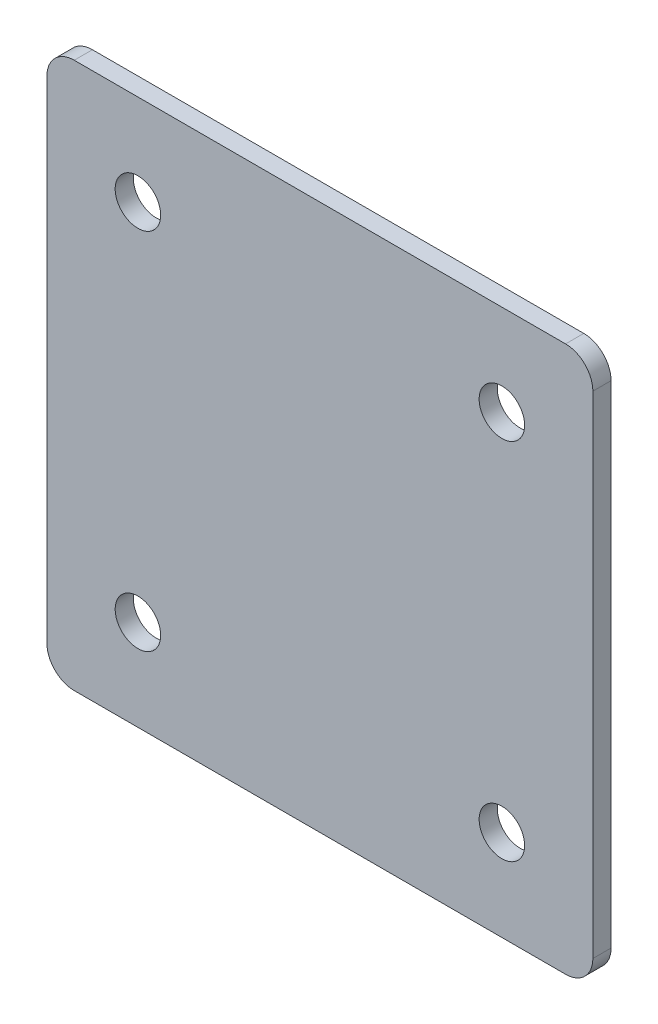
ISO-10303-21;
HEADER;
FILE_DESCRIPTION(('STEP AP214'),'2;1');
FILE_NAME('part.step','',(''),(''),'','','');
FILE_SCHEMA(('AUTOMOTIVE_DESIGN { 1 0 10303 214 1 1 1 1 }'));
ENDSEC;
DATA;
#1=APPLICATION_CONTEXT('core data for automotive mechanical design processes');
#2=APPLICATION_PROTOCOL_DEFINITION('international standard','automotive_design',2000,#1);
#3=PRODUCT_CONTEXT('',#1,'mechanical');
#4=PRODUCT('Part','Part','',(#3));
#5=PRODUCT_RELATED_PRODUCT_CATEGORY('part','',(#4));
#6=PRODUCT_DEFINITION_FORMATION('','',#4);
#7=PRODUCT_DEFINITION_CONTEXT('part definition',#1,'design');
#8=PRODUCT_DEFINITION('design','',#6,#7);
#9=PRODUCT_DEFINITION_SHAPE('','',#8);
#10=(LENGTH_UNIT() NAMED_UNIT(*) SI_UNIT(.MILLI.,.METRE.));
#11=(NAMED_UNIT(*) PLANE_ANGLE_UNIT() SI_UNIT($,.RADIAN.));
#12=(NAMED_UNIT(*) SI_UNIT($,.STERADIAN.) SOLID_ANGLE_UNIT());
#13=UNCERTAINTY_MEASURE_WITH_UNIT(LENGTH_MEASURE(1.E-05),#10,'distance_accuracy_value','');
#14=(GEOMETRIC_REPRESENTATION_CONTEXT(3) GLOBAL_UNCERTAINTY_ASSIGNED_CONTEXT((#13)) GLOBAL_UNIT_ASSIGNED_CONTEXT((#10,
#11,#12)) REPRESENTATION_CONTEXT('',''));
#15=CARTESIAN_POINT('',(0.,0.,0.));
#16=DIRECTION('',(0.,0.,1.));
#17=DIRECTION('',(1.,0.,0.));
#18=AXIS2_PLACEMENT_3D('',#15,#16,#17);
#19=CARTESIAN_POINT('',(60.,60.,4.));
#20=DIRECTION('',(-1.,0.,0.));
#21=DIRECTION('',(0.,0.,1.));
#22=AXIS2_PLACEMENT_3D('',#19,#20,#21);
#23=PLANE('',#22);
#24=DIRECTION('',(0.,1.,0.));
#25=VECTOR('',#24,1.);
#26=CARTESIAN_POINT('',(60.,60.,4.));
#27=LINE('',#26,#25);
#28=CARTESIAN_POINT('',(60.,-54.,4.));
#29=VERTEX_POINT('',#28);
#30=CARTESIAN_POINT('',(60.,54.,4.));
#31=VERTEX_POINT('',#30);
#32=EDGE_CURVE('E125',#29,#31,#27,.T.);
#33=ORIENTED_EDGE('',*,*,#32,.F.);
#34=DIRECTION('',(0.,0.,-1.));
#35=VECTOR('',#34,1.);
#36=CARTESIAN_POINT('',(60.,-54.,4.));
#37=LINE('',#36,#35);
#38=CARTESIAN_POINT('',(60.,-54.,0.));
#39=VERTEX_POINT('',#38);
#40=EDGE_CURVE('E151',#29,#39,#37,.T.);
#41=ORIENTED_EDGE('',*,*,#40,.T.);
#42=DIRECTION('',(0.,1.,0.));
#43=VECTOR('',#42,1.);
#44=CARTESIAN_POINT('',(60.,60.,0.));
#45=LINE('',#44,#43);
#46=CARTESIAN_POINT('',(60.,54.,0.));
#47=VERTEX_POINT('',#46);
#48=EDGE_CURVE('E157',#39,#47,#45,.T.);
#49=ORIENTED_EDGE('',*,*,#48,.T.);
#50=DIRECTION('',(0.,0.,-1.));
#51=VECTOR('',#50,1.);
#52=CARTESIAN_POINT('',(60.,54.,4.));
#53=LINE('',#52,#51);
#54=EDGE_CURVE('E149',#47,#31,#53,.F.);
#55=ORIENTED_EDGE('',*,*,#54,.T.);
#56=EDGE_LOOP('',(#33,#41,#49,#55));
#57=FACE_BOUND('',#56,.T.);
#58=ADVANCED_FACE('F33',(#57),#23,.F.);
#59=CARTESIAN_POINT('',(-60.,60.,4.));
#60=DIRECTION('',(0.,-1.,0.));
#61=DIRECTION('',(0.,0.,-1.));
#62=AXIS2_PLACEMENT_3D('',#59,#60,#61);
#63=PLANE('',#62);
#64=DIRECTION('',(-1.,0.,0.));
#65=VECTOR('',#64,1.);
#66=CARTESIAN_POINT('',(-60.,60.,4.));
#67=LINE('',#66,#65);
#68=CARTESIAN_POINT('',(54.,60.,4.));
#69=VERTEX_POINT('',#68);
#70=CARTESIAN_POINT('',(-54.,60.,4.));
#71=VERTEX_POINT('',#70);
#72=EDGE_CURVE('E128',#69,#71,#67,.T.);
#73=ORIENTED_EDGE('',*,*,#72,.F.);
#74=DIRECTION('',(0.,0.,-1.));
#75=VECTOR('',#74,1.);
#76=CARTESIAN_POINT('',(54.,60.,4.));
#77=LINE('',#76,#75);
#78=CARTESIAN_POINT('',(54.,60.,0.));
#79=VERTEX_POINT('',#78);
#80=EDGE_CURVE('E11',#69,#79,#77,.T.);
#81=ORIENTED_EDGE('',*,*,#80,.T.);
#82=DIRECTION('',(-1.,0.,0.));
#83=VECTOR('',#82,1.);
#84=CARTESIAN_POINT('',(-60.,60.,0.));
#85=LINE('',#84,#83);
#86=CARTESIAN_POINT('',(-54.,60.,0.));
#87=VERTEX_POINT('',#86);
#88=EDGE_CURVE('E130',#79,#87,#85,.T.);
#89=ORIENTED_EDGE('',*,*,#88,.T.);
#90=DIRECTION('',(0.,0.,-1.));
#91=VECTOR('',#90,1.);
#92=CARTESIAN_POINT('',(-54.,60.,4.));
#93=LINE('',#92,#91);
#94=EDGE_CURVE('E41',#87,#71,#93,.F.);
#95=ORIENTED_EDGE('',*,*,#94,.T.);
#96=EDGE_LOOP('',(#73,#81,#89,#95));
#97=FACE_BOUND('',#96,.T.);
#98=ADVANCED_FACE('F218',(#97),#63,.F.);
#99=CARTESIAN_POINT('',(-60.,60.,4.));
#100=DIRECTION('',(1.,0.,0.));
#101=DIRECTION('',(0.,1.,0.));
#102=AXIS2_PLACEMENT_3D('',#99,#100,#101);
#103=PLANE('',#102);
#104=DIRECTION('',(0.,-1.,0.));
#105=VECTOR('',#104,1.);
#106=CARTESIAN_POINT('',(-60.,60.,0.));
#107=LINE('',#106,#105);
#108=CARTESIAN_POINT('',(-60.,54.,0.));
#109=VERTEX_POINT('',#108);
#110=CARTESIAN_POINT('',(-60.,-54.,0.));
#111=VERTEX_POINT('',#110);
#112=EDGE_CURVE('E126',#109,#111,#107,.T.);
#113=ORIENTED_EDGE('',*,*,#112,.T.);
#114=DIRECTION('',(0.,0.,-1.));
#115=VECTOR('',#114,1.);
#116=CARTESIAN_POINT('',(-60.,-54.,4.));
#117=LINE('',#116,#115);
#118=CARTESIAN_POINT('',(-60.,-54.,4.));
#119=VERTEX_POINT('',#118);
#120=EDGE_CURVE('E104',#111,#119,#117,.F.);
#121=ORIENTED_EDGE('',*,*,#120,.T.);
#122=DIRECTION('',(0.,-1.,0.));
#123=VECTOR('',#122,1.);
#124=CARTESIAN_POINT('',(-60.,60.,4.));
#125=LINE('',#124,#123);
#126=CARTESIAN_POINT('',(-60.,54.,4.));
#127=VERTEX_POINT('',#126);
#128=EDGE_CURVE('E169',#127,#119,#125,.T.);
#129=ORIENTED_EDGE('',*,*,#128,.F.);
#130=DIRECTION('',(0.,0.,-1.));
#131=VECTOR('',#130,1.);
#132=CARTESIAN_POINT('',(-60.,54.,4.));
#133=LINE('',#132,#131);
#134=EDGE_CURVE('E109',#127,#109,#133,.T.);
#135=ORIENTED_EDGE('',*,*,#134,.T.);
#136=EDGE_LOOP('',(#113,#121,#129,#135));
#137=FACE_BOUND('',#136,.T.);
#138=ADVANCED_FACE('F216',(#137),#103,.F.);
#139=CARTESIAN_POINT('',(-60.,-60.,4.));
#140=DIRECTION('',(0.,1.,0.));
#141=DIRECTION('',(-1.,0.,0.));
#142=AXIS2_PLACEMENT_3D('',#139,#140,#141);
#143=PLANE('',#142);
#144=DIRECTION('',(1.,0.,0.));
#145=VECTOR('',#144,1.);
#146=CARTESIAN_POINT('',(-60.,-60.,4.));
#147=LINE('',#146,#145);
#148=CARTESIAN_POINT('',(-54.,-60.,4.));
#149=VERTEX_POINT('',#148);
#150=CARTESIAN_POINT('',(54.,-60.,4.));
#151=VERTEX_POINT('',#150);
#152=EDGE_CURVE('E119',#149,#151,#147,.T.);
#153=ORIENTED_EDGE('',*,*,#152,.F.);
#154=DIRECTION('',(0.,0.,-1.));
#155=VECTOR('',#154,1.);
#156=CARTESIAN_POINT('',(-54.,-60.,4.));
#157=LINE('',#156,#155);
#158=CARTESIAN_POINT('',(-54.,-60.,0.));
#159=VERTEX_POINT('',#158);
#160=EDGE_CURVE('E103',#149,#159,#157,.T.);
#161=ORIENTED_EDGE('',*,*,#160,.T.);
#162=DIRECTION('',(1.,0.,0.));
#163=VECTOR('',#162,1.);
#164=CARTESIAN_POINT('',(-60.,-60.,0.));
#165=LINE('',#164,#163);
#166=CARTESIAN_POINT('',(54.,-60.,0.));
#167=VERTEX_POINT('',#166);
#168=EDGE_CURVE('E116',#159,#167,#165,.T.);
#169=ORIENTED_EDGE('',*,*,#168,.T.);
#170=DIRECTION('',(0.,0.,-1.));
#171=VECTOR('',#170,1.);
#172=CARTESIAN_POINT('',(54.,-60.,4.));
#173=LINE('',#172,#171);
#174=EDGE_CURVE('E121',#167,#151,#173,.F.);
#175=ORIENTED_EDGE('',*,*,#174,.T.);
#176=EDGE_LOOP('',(#153,#161,#169,#175));
#177=FACE_BOUND('',#176,.T.);
#178=ADVANCED_FACE('F115',(#177),#143,.F.);
#179=CARTESIAN_POINT('',(60.,-60.,4.));
#180=DIRECTION('',(0.,0.,1.));
#181=DIRECTION('',(1.,0.,0.));
#182=AXIS2_PLACEMENT_3D('',#179,#180,#181);
#183=PLANE('',#182);
#184=CARTESIAN_POINT('',(40.,-40.,4.));
#185=DIRECTION('',(0.,0.,1.));
#186=DIRECTION('',(1.,0.,0.));
#187=AXIS2_PLACEMENT_3D('',#184,#185,#186);
#188=CIRCLE('',#187,5.);
#189=CARTESIAN_POINT('',(45.,-40.,4.));
#190=VERTEX_POINT('',#189);
#191=EDGE_CURVE('E188',#190,#190,#188,.T.);
#192=ORIENTED_EDGE('',*,*,#191,.F.);
#193=EDGE_LOOP('',(#192));
#194=FACE_BOUND('',#193,.T.);
#195=CARTESIAN_POINT('',(-40.,-40.,4.));
#196=DIRECTION('',(0.,0.,1.));
#197=DIRECTION('',(1.,0.,0.));
#198=AXIS2_PLACEMENT_3D('',#195,#196,#197);
#199=CIRCLE('',#198,5.);
#200=CARTESIAN_POINT('',(-35.,-40.,4.));
#201=VERTEX_POINT('',#200);
#202=EDGE_CURVE('E182',#201,#201,#199,.T.);
#203=ORIENTED_EDGE('',*,*,#202,.F.);
#204=EDGE_LOOP('',(#203));
#205=FACE_BOUND('',#204,.T.);
#206=CARTESIAN_POINT('',(40.,40.,4.));
#207=DIRECTION('',(0.,0.,1.));
#208=DIRECTION('',(1.,0.,0.));
#209=AXIS2_PLACEMENT_3D('',#206,#207,#208);
#210=CIRCLE('',#209,5.);
#211=CARTESIAN_POINT('',(45.,40.,4.));
#212=VERTEX_POINT('',#211);
#213=EDGE_CURVE('E176',#212,#212,#210,.T.);
#214=ORIENTED_EDGE('',*,*,#213,.F.);
#215=EDGE_LOOP('',(#214));
#216=FACE_BOUND('',#215,.T.);
#217=CARTESIAN_POINT('',(-40.,40.,4.));
#218=DIRECTION('',(0.,0.,1.));
#219=DIRECTION('',(1.,0.,0.));
#220=AXIS2_PLACEMENT_3D('',#217,#218,#219);
#221=CIRCLE('',#220,5.);
#222=CARTESIAN_POINT('',(-35.,40.,4.));
#223=VERTEX_POINT('',#222);
#224=EDGE_CURVE('E165',#223,#223,#221,.T.);
#225=ORIENTED_EDGE('',*,*,#224,.F.);
#226=EDGE_LOOP('',(#225));
#227=FACE_BOUND('',#226,.T.);
#228=ORIENTED_EDGE('',*,*,#128,.T.);
#229=CARTESIAN_POINT('',(-54.,-54.,4.));
#230=DIRECTION('',(0.,0.,1.));
#231=DIRECTION('',(1.,0.,0.));
#232=AXIS2_PLACEMENT_3D('',#229,#230,#231);
#233=CIRCLE('',#232,6.);
#234=EDGE_CURVE('E147',#119,#149,#233,.T.);
#235=ORIENTED_EDGE('',*,*,#234,.T.);
#236=ORIENTED_EDGE('',*,*,#152,.T.);
#237=CARTESIAN_POINT('',(54.,-54.,4.));
#238=DIRECTION('',(0.,0.,1.));
#239=DIRECTION('',(1.,0.,0.));
#240=AXIS2_PLACEMENT_3D('',#237,#238,#239);
#241=CIRCLE('',#240,6.);
#242=EDGE_CURVE('E145',#151,#29,#241,.T.);
#243=ORIENTED_EDGE('',*,*,#242,.T.);
#244=ORIENTED_EDGE('',*,*,#32,.T.);
#245=CARTESIAN_POINT('',(54.,54.,4.));
#246=DIRECTION('',(0.,0.,1.));
#247=DIRECTION('',(1.,0.,0.));
#248=AXIS2_PLACEMENT_3D('',#245,#246,#247);
#249=CIRCLE('',#248,6.);
#250=EDGE_CURVE('E54',#31,#69,#249,.T.);
#251=ORIENTED_EDGE('',*,*,#250,.T.);
#252=ORIENTED_EDGE('',*,*,#72,.T.);
#253=CARTESIAN_POINT('',(-54.,54.,4.));
#254=DIRECTION('',(0.,0.,1.));
#255=DIRECTION('',(1.,0.,0.));
#256=AXIS2_PLACEMENT_3D('',#253,#254,#255);
#257=CIRCLE('',#256,6.);
#258=EDGE_CURVE('E142',#71,#127,#257,.T.);
#259=ORIENTED_EDGE('',*,*,#258,.T.);
#260=EDGE_LOOP('',(#228,#235,#236,#243,#244,#251,#252,#259));
#261=FACE_BOUND('',#260,.T.);
#262=ADVANCED_FACE('F203',(#194,#205,#216,#227,#261),#183,.T.);
#263=CARTESIAN_POINT('',(60.,-60.,0.));
#264=DIRECTION('',(0.,0.,1.));
#265=DIRECTION('',(1.,0.,0.));
#266=AXIS2_PLACEMENT_3D('',#263,#264,#265);
#267=PLANE('',#266);
#268=CARTESIAN_POINT('',(40.,-40.,0.));
#269=DIRECTION('',(0.,0.,1.));
#270=DIRECTION('',(1.,0.,0.));
#271=AXIS2_PLACEMENT_3D('',#268,#269,#270);
#272=CIRCLE('',#271,5.);
#273=CARTESIAN_POINT('',(45.,-40.,0.));
#274=VERTEX_POINT('',#273);
#275=EDGE_CURVE('E185',#274,#274,#272,.T.);
#276=ORIENTED_EDGE('',*,*,#275,.T.);
#277=EDGE_LOOP('',(#276));
#278=FACE_BOUND('',#277,.T.);
#279=CARTESIAN_POINT('',(-40.,-40.,0.));
#280=DIRECTION('',(0.,0.,1.));
#281=DIRECTION('',(1.,0.,0.));
#282=AXIS2_PLACEMENT_3D('',#279,#280,#281);
#283=CIRCLE('',#282,5.);
#284=CARTESIAN_POINT('',(-35.,-40.,0.));
#285=VERTEX_POINT('',#284);
#286=EDGE_CURVE('E179',#285,#285,#283,.T.);
#287=ORIENTED_EDGE('',*,*,#286,.T.);
#288=EDGE_LOOP('',(#287));
#289=FACE_BOUND('',#288,.T.);
#290=CARTESIAN_POINT('',(40.,40.,0.));
#291=DIRECTION('',(0.,0.,1.));
#292=DIRECTION('',(1.,0.,0.));
#293=AXIS2_PLACEMENT_3D('',#290,#291,#292);
#294=CIRCLE('',#293,5.);
#295=CARTESIAN_POINT('',(45.,40.,0.));
#296=VERTEX_POINT('',#295);
#297=EDGE_CURVE('E174',#296,#296,#294,.T.);
#298=ORIENTED_EDGE('',*,*,#297,.T.);
#299=EDGE_LOOP('',(#298));
#300=FACE_BOUND('',#299,.T.);
#301=CARTESIAN_POINT('',(-40.,40.,0.));
#302=DIRECTION('',(0.,0.,1.));
#303=DIRECTION('',(1.,0.,0.));
#304=AXIS2_PLACEMENT_3D('',#301,#302,#303);
#305=CIRCLE('',#304,5.);
#306=CARTESIAN_POINT('',(-35.,40.,0.));
#307=VERTEX_POINT('',#306);
#308=EDGE_CURVE('E162',#307,#307,#305,.T.);
#309=ORIENTED_EDGE('',*,*,#308,.T.);
#310=EDGE_LOOP('',(#309));
#311=FACE_BOUND('',#310,.T.);
#312=ORIENTED_EDGE('',*,*,#168,.F.);
#313=CARTESIAN_POINT('',(-54.,-54.,0.));
#314=DIRECTION('',(0.,0.,1.));
#315=DIRECTION('',(1.,0.,0.));
#316=AXIS2_PLACEMENT_3D('',#313,#314,#315);
#317=CIRCLE('',#316,6.);
#318=EDGE_CURVE('E99',#159,#111,#317,.F.);
#319=ORIENTED_EDGE('',*,*,#318,.T.);
#320=ORIENTED_EDGE('',*,*,#112,.F.);
#321=CARTESIAN_POINT('',(-54.,54.,0.));
#322=DIRECTION('',(0.,0.,1.));
#323=DIRECTION('',(1.,0.,0.));
#324=AXIS2_PLACEMENT_3D('',#321,#322,#323);
#325=CIRCLE('',#324,6.);
#326=EDGE_CURVE('E120',#109,#87,#325,.F.);
#327=ORIENTED_EDGE('',*,*,#326,.T.);
#328=ORIENTED_EDGE('',*,*,#88,.F.);
#329=CARTESIAN_POINT('',(54.,54.,0.));
#330=DIRECTION('',(0.,0.,1.));
#331=DIRECTION('',(1.,0.,0.));
#332=AXIS2_PLACEMENT_3D('',#329,#330,#331);
#333=CIRCLE('',#332,6.);
#334=EDGE_CURVE('E136',#79,#47,#333,.F.);
#335=ORIENTED_EDGE('',*,*,#334,.T.);
#336=ORIENTED_EDGE('',*,*,#48,.F.);
#337=CARTESIAN_POINT('',(54.,-54.,0.));
#338=DIRECTION('',(0.,0.,1.));
#339=DIRECTION('',(1.,0.,0.));
#340=AXIS2_PLACEMENT_3D('',#337,#338,#339);
#341=CIRCLE('',#340,6.);
#342=EDGE_CURVE('E110',#39,#167,#341,.F.);
#343=ORIENTED_EDGE('',*,*,#342,.T.);
#344=EDGE_LOOP('',(#312,#319,#320,#327,#328,#335,#336,#343));
#345=FACE_BOUND('',#344,.T.);
#346=ADVANCED_FACE('F123',(#278,#289,#300,#311,#345),#267,.F.);
#347=CARTESIAN_POINT('',(-54.,-54.,4.));
#348=DIRECTION('',(0.,0.,-1.));
#349=DIRECTION('',(-1.,0.,0.));
#350=AXIS2_PLACEMENT_3D('',#347,#348,#349);
#351=CYLINDRICAL_SURFACE('',#350,6.);
#352=ORIENTED_EDGE('',*,*,#234,.F.);
#353=ORIENTED_EDGE('',*,*,#120,.F.);
#354=ORIENTED_EDGE('',*,*,#318,.F.);
#355=ORIENTED_EDGE('',*,*,#160,.F.);
#356=EDGE_LOOP('',(#352,#353,#354,#355));
#357=FACE_BOUND('',#356,.T.);
#358=ADVANCED_FACE('F102',(#357),#351,.T.);
#359=CARTESIAN_POINT('',(54.,-54.,4.));
#360=DIRECTION('',(0.,0.,-1.));
#361=DIRECTION('',(-1.,0.,0.));
#362=AXIS2_PLACEMENT_3D('',#359,#360,#361);
#363=CYLINDRICAL_SURFACE('',#362,6.);
#364=ORIENTED_EDGE('',*,*,#242,.F.);
#365=ORIENTED_EDGE('',*,*,#174,.F.);
#366=ORIENTED_EDGE('',*,*,#342,.F.);
#367=ORIENTED_EDGE('',*,*,#40,.F.);
#368=EDGE_LOOP('',(#364,#365,#366,#367));
#369=FACE_BOUND('',#368,.T.);
#370=ADVANCED_FACE('F222',(#369),#363,.T.);
#371=CARTESIAN_POINT('',(54.,54.,4.));
#372=DIRECTION('',(0.,0.,-1.));
#373=DIRECTION('',(-1.,0.,0.));
#374=AXIS2_PLACEMENT_3D('',#371,#372,#373);
#375=CYLINDRICAL_SURFACE('',#374,6.);
#376=ORIENTED_EDGE('',*,*,#250,.F.);
#377=ORIENTED_EDGE('',*,*,#54,.F.);
#378=ORIENTED_EDGE('',*,*,#334,.F.);
#379=ORIENTED_EDGE('',*,*,#80,.F.);
#380=EDGE_LOOP('',(#376,#377,#378,#379));
#381=FACE_BOUND('',#380,.T.);
#382=ADVANCED_FACE('F221',(#381),#375,.T.);
#383=CARTESIAN_POINT('',(-54.,54.,4.));
#384=DIRECTION('',(0.,0.,-1.));
#385=DIRECTION('',(-1.,0.,0.));
#386=AXIS2_PLACEMENT_3D('',#383,#384,#385);
#387=CYLINDRICAL_SURFACE('',#386,6.);
#388=ORIENTED_EDGE('',*,*,#258,.F.);
#389=ORIENTED_EDGE('',*,*,#94,.F.);
#390=ORIENTED_EDGE('',*,*,#326,.F.);
#391=ORIENTED_EDGE('',*,*,#134,.F.);
#392=EDGE_LOOP('',(#388,#389,#390,#391));
#393=FACE_BOUND('',#392,.T.);
#394=ADVANCED_FACE('F35',(#393),#387,.T.);
#395=CARTESIAN_POINT('',(-40.,40.,0.));
#396=DIRECTION('',(0.,0.,1.));
#397=DIRECTION('',(1.,0.,0.));
#398=AXIS2_PLACEMENT_3D('',#395,#396,#397);
#399=CYLINDRICAL_SURFACE('',#398,5.);
#400=ORIENTED_EDGE('',*,*,#308,.F.);
#401=EDGE_LOOP('',(#400));
#402=FACE_BOUND('',#401,.T.);
#403=ORIENTED_EDGE('',*,*,#224,.T.);
#404=EDGE_LOOP('',(#403));
#405=FACE_BOUND('',#404,.T.);
#406=ADVANCED_FACE('F243',(#402,#405),#399,.F.);
#407=CARTESIAN_POINT('',(40.,40.,0.));
#408=DIRECTION('',(0.,0.,1.));
#409=DIRECTION('',(1.,0.,0.));
#410=AXIS2_PLACEMENT_3D('',#407,#408,#409);
#411=CYLINDRICAL_SURFACE('',#410,5.);
#412=ORIENTED_EDGE('',*,*,#297,.F.);
#413=EDGE_LOOP('',(#412));
#414=FACE_BOUND('',#413,.T.);
#415=ORIENTED_EDGE('',*,*,#213,.T.);
#416=EDGE_LOOP('',(#415));
#417=FACE_BOUND('',#416,.T.);
#418=ADVANCED_FACE('F246',(#414,#417),#411,.F.);
#419=CARTESIAN_POINT('',(-40.,-40.,0.));
#420=DIRECTION('',(0.,0.,1.));
#421=DIRECTION('',(1.,0.,0.));
#422=AXIS2_PLACEMENT_3D('',#419,#420,#421);
#423=CYLINDRICAL_SURFACE('',#422,5.);
#424=ORIENTED_EDGE('',*,*,#286,.F.);
#425=EDGE_LOOP('',(#424));
#426=FACE_BOUND('',#425,.T.);
#427=ORIENTED_EDGE('',*,*,#202,.T.);
#428=EDGE_LOOP('',(#427));
#429=FACE_BOUND('',#428,.T.);
#430=ADVANCED_FACE('F199',(#426,#429),#423,.F.);
#431=CARTESIAN_POINT('',(40.,-40.,0.));
#432=DIRECTION('',(0.,0.,1.));
#433=DIRECTION('',(1.,0.,0.));
#434=AXIS2_PLACEMENT_3D('',#431,#432,#433);
#435=CYLINDRICAL_SURFACE('',#434,5.);
#436=ORIENTED_EDGE('',*,*,#275,.F.);
#437=EDGE_LOOP('',(#436));
#438=FACE_BOUND('',#437,.T.);
#439=ORIENTED_EDGE('',*,*,#191,.T.);
#440=EDGE_LOOP('',(#439));
#441=FACE_BOUND('',#440,.T.);
#442=ADVANCED_FACE('F196',(#438,#441),#435,.F.);
#443=CLOSED_SHELL('',(#58,#98,#138,#178,#262,#346,#358,#370,#382,#394,#406,#418,#430,#442));
#444=MANIFOLD_SOLID_BREP('B2',#443);
#445=ADVANCED_BREP_SHAPE_REPRESENTATION('',(#18,#444),#14);
#446=SHAPE_DEFINITION_REPRESENTATION(#9,#445);
ENDSEC;
END-ISO-10303-21;
